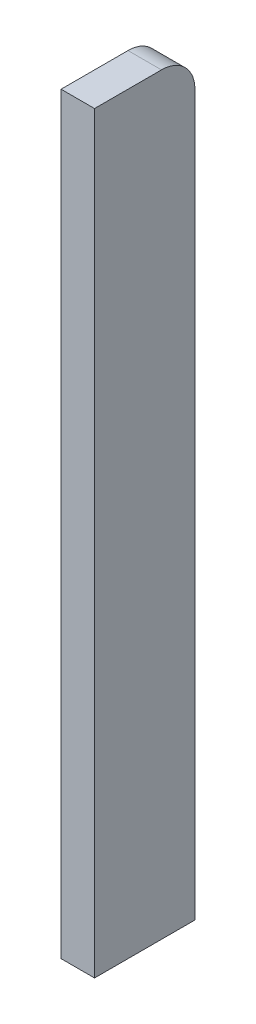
ISO-10303-21;
HEADER;
FILE_DESCRIPTION(('STEP AP214'),'2;1');
FILE_NAME('part.step','',(''),(''),'','','');
FILE_SCHEMA(('AUTOMOTIVE_DESIGN { 1 0 10303 214 1 1 1 1 }'));
ENDSEC;
DATA;
#1=APPLICATION_CONTEXT('core data for automotive mechanical design processes');
#2=APPLICATION_PROTOCOL_DEFINITION('international standard','automotive_design',2000,#1);
#3=PRODUCT_CONTEXT('',#1,'mechanical');
#4=PRODUCT('Part','Part','',(#3));
#5=PRODUCT_RELATED_PRODUCT_CATEGORY('part','',(#4));
#6=PRODUCT_DEFINITION_FORMATION('','',#4);
#7=PRODUCT_DEFINITION_CONTEXT('part definition',#1,'design');
#8=PRODUCT_DEFINITION('design','',#6,#7);
#9=PRODUCT_DEFINITION_SHAPE('','',#8);
#10=(LENGTH_UNIT() NAMED_UNIT(*) SI_UNIT(.MILLI.,.METRE.));
#11=(NAMED_UNIT(*) PLANE_ANGLE_UNIT() SI_UNIT($,.RADIAN.));
#12=(NAMED_UNIT(*) SI_UNIT($,.STERADIAN.) SOLID_ANGLE_UNIT());
#13=UNCERTAINTY_MEASURE_WITH_UNIT(LENGTH_MEASURE(1.E-05),#10,'distance_accuracy_value','');
#14=(GEOMETRIC_REPRESENTATION_CONTEXT(3) GLOBAL_UNCERTAINTY_ASSIGNED_CONTEXT((#13)) GLOBAL_UNIT_ASSIGNED_CONTEXT((#10,
#11,#12)) REPRESENTATION_CONTEXT('',''));
#15=CARTESIAN_POINT('',(0.,0.,0.));
#16=DIRECTION('',(0.,0.,1.));
#17=DIRECTION('',(1.,0.,0.));
#18=AXIS2_PLACEMENT_3D('',#15,#16,#17);
#19=CARTESIAN_POINT('',(0.,142.875,-19.05));
#20=DIRECTION('',(-1.,0.,0.));
#21=DIRECTION('',(0.,-1.,0.));
#22=AXIS2_PLACEMENT_3D('',#19,#20,#21);
#23=PLANE('',#22);
#24=DIRECTION('',(0.,-1.,0.));
#25=VECTOR('',#24,1.);
#26=CARTESIAN_POINT('',(0.,142.875,-19.05));
#27=LINE('',#26,#25);
#28=CARTESIAN_POINT('',(0.,136.525,-19.05));
#29=VERTEX_POINT('',#28);
#30=CARTESIAN_POINT('',(0.,0.,-19.05));
#31=VERTEX_POINT('',#30);
#32=EDGE_CURVE('E78',#29,#31,#27,.T.);
#33=ORIENTED_EDGE('',*,*,#32,.F.);
#34=CARTESIAN_POINT('',(0.,136.525,-12.7));
#35=DIRECTION('',(-1.,0.,0.));
#36=DIRECTION('',(0.,-1.,0.));
#37=AXIS2_PLACEMENT_3D('',#34,#35,#36);
#38=CIRCLE('',#37,6.35);
#39=CARTESIAN_POINT('',(0.,142.875,-12.7));
#40=VERTEX_POINT('',#39);
#41=EDGE_CURVE('E56',#29,#40,#38,.F.);
#42=ORIENTED_EDGE('',*,*,#41,.T.);
#43=DIRECTION('',(0.,0.,1.));
#44=VECTOR('',#43,1.);
#45=CARTESIAN_POINT('',(0.,142.875,-19.05));
#46=LINE('',#45,#44);
#47=CARTESIAN_POINT('',(0.,142.875,0.));
#48=VERTEX_POINT('',#47);
#49=EDGE_CURVE('E108',#40,#48,#46,.T.);
#50=ORIENTED_EDGE('',*,*,#49,.T.);
#51=DIRECTION('',(0.,-1.,0.));
#52=VECTOR('',#51,1.);
#53=CARTESIAN_POINT('',(0.,142.875,0.));
#54=LINE('',#53,#52);
#55=CARTESIAN_POINT('',(0.,0.,0.));
#56=VERTEX_POINT('',#55);
#57=EDGE_CURVE('E100',#48,#56,#54,.T.);
#58=ORIENTED_EDGE('',*,*,#57,.T.);
#59=DIRECTION('',(0.,0.,1.));
#60=VECTOR('',#59,1.);
#61=CARTESIAN_POINT('',(0.,0.,-19.05));
#62=LINE('',#61,#60);
#63=EDGE_CURVE('E92',#31,#56,#62,.T.);
#64=ORIENTED_EDGE('',*,*,#63,.F.);
#65=EDGE_LOOP('',(#33,#42,#50,#58,#64));
#66=FACE_BOUND('',#65,.T.);
#67=ADVANCED_FACE('F34',(#66),#23,.F.);
#68=CARTESIAN_POINT('',(0.,0.,-19.05));
#69=DIRECTION('',(0.,1.,0.));
#70=DIRECTION('',(0.,0.,1.));
#71=AXIS2_PLACEMENT_3D('',#68,#69,#70);
#72=PLANE('',#71);
#73=DIRECTION('',(-1.,0.,0.));
#74=VECTOR('',#73,1.);
#75=CARTESIAN_POINT('',(0.,0.,0.));
#76=LINE('',#75,#74);
#77=CARTESIAN_POINT('',(-6.34999999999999,0.,0.));
#78=VERTEX_POINT('',#77);
#79=EDGE_CURVE('E115',#56,#78,#76,.T.);
#80=ORIENTED_EDGE('',*,*,#79,.T.);
#81=DIRECTION('',(0.,0.,1.));
#82=VECTOR('',#81,1.);
#83=CARTESIAN_POINT('',(-6.34999999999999,0.,-19.05));
#84=LINE('',#83,#82);
#85=CARTESIAN_POINT('',(-6.34999999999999,0.,-19.05));
#86=VERTEX_POINT('',#85);
#87=EDGE_CURVE('E95',#86,#78,#84,.T.);
#88=ORIENTED_EDGE('',*,*,#87,.F.);
#89=DIRECTION('',(-1.,0.,0.));
#90=VECTOR('',#89,1.);
#91=CARTESIAN_POINT('',(0.,0.,-19.05));
#92=LINE('',#91,#90);
#93=EDGE_CURVE('E82',#31,#86,#92,.T.);
#94=ORIENTED_EDGE('',*,*,#93,.F.);
#95=ORIENTED_EDGE('',*,*,#63,.T.);
#96=EDGE_LOOP('',(#80,#88,#94,#95));
#97=FACE_BOUND('',#96,.T.);
#98=ADVANCED_FACE('F91',(#97),#72,.F.);
#99=CARTESIAN_POINT('',(-6.34999999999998,142.875,-19.05));
#100=DIRECTION('',(1.,0.,0.));
#101=DIRECTION('',(0.,1.,0.));
#102=AXIS2_PLACEMENT_3D('',#99,#100,#101);
#103=PLANE('',#102);
#104=DIRECTION('',(0.,0.,1.));
#105=VECTOR('',#104,1.);
#106=CARTESIAN_POINT('',(-6.34999999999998,142.875,-19.05));
#107=LINE('',#106,#105);
#108=CARTESIAN_POINT('',(-6.34999999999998,142.875,-12.7));
#109=VERTEX_POINT('',#108);
#110=CARTESIAN_POINT('',(-6.34999999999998,142.875,0.));
#111=VERTEX_POINT('',#110);
#112=EDGE_CURVE('E103',#109,#111,#107,.T.);
#113=ORIENTED_EDGE('',*,*,#112,.F.);
#114=CARTESIAN_POINT('',(-6.34999999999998,136.525,-12.7));
#115=DIRECTION('',(1.,0.,0.));
#116=DIRECTION('',(0.,1.,0.));
#117=AXIS2_PLACEMENT_3D('',#114,#115,#116);
#118=CIRCLE('',#117,6.35);
#119=CARTESIAN_POINT('',(-6.34999999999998,136.525,-19.05));
#120=VERTEX_POINT('',#119);
#121=EDGE_CURVE('E11',#109,#120,#118,.F.);
#122=ORIENTED_EDGE('',*,*,#121,.T.);
#123=DIRECTION('',(0.,1.,0.));
#124=VECTOR('',#123,1.);
#125=CARTESIAN_POINT('',(-6.34999999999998,142.875,-19.05));
#126=LINE('',#125,#124);
#127=EDGE_CURVE('E97',#86,#120,#126,.T.);
#128=ORIENTED_EDGE('',*,*,#127,.F.);
#129=ORIENTED_EDGE('',*,*,#87,.T.);
#130=DIRECTION('',(0.,1.,0.));
#131=VECTOR('',#130,1.);
#132=CARTESIAN_POINT('',(-6.34999999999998,142.875,0.));
#133=LINE('',#132,#131);
#134=EDGE_CURVE('E112',#78,#111,#133,.T.);
#135=ORIENTED_EDGE('',*,*,#134,.T.);
#136=EDGE_LOOP('',(#113,#122,#128,#129,#135));
#137=FACE_BOUND('',#136,.T.);
#138=ADVANCED_FACE('F121',(#137),#103,.F.);
#139=CARTESIAN_POINT('',(0.,142.875,-19.05));
#140=DIRECTION('',(0.,-1.,0.));
#141=DIRECTION('',(0.,0.,-1.));
#142=AXIS2_PLACEMENT_3D('',#139,#140,#141);
#143=PLANE('',#142);
#144=ORIENTED_EDGE('',*,*,#49,.F.);
#145=DIRECTION('',(1.,0.,0.));
#146=VECTOR('',#145,1.);
#147=CARTESIAN_POINT('',(-6.34999999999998,142.875,-12.7));
#148=LINE('',#147,#146);
#149=EDGE_CURVE('E42',#40,#109,#148,.F.);
#150=ORIENTED_EDGE('',*,*,#149,.T.);
#151=ORIENTED_EDGE('',*,*,#112,.T.);
#152=DIRECTION('',(1.,0.,0.));
#153=VECTOR('',#152,1.);
#154=CARTESIAN_POINT('',(0.,142.875,0.));
#155=LINE('',#154,#153);
#156=EDGE_CURVE('E87',#111,#48,#155,.T.);
#157=ORIENTED_EDGE('',*,*,#156,.T.);
#158=EDGE_LOOP('',(#144,#150,#151,#157));
#159=FACE_BOUND('',#158,.T.);
#160=ADVANCED_FACE('F124',(#159),#143,.F.);
#161=CARTESIAN_POINT('',(0.,0.,-19.05));
#162=DIRECTION('',(0.,0.,-1.));
#163=DIRECTION('',(-1.,0.,0.));
#164=AXIS2_PLACEMENT_3D('',#161,#162,#163);
#165=PLANE('',#164);
#166=ORIENTED_EDGE('',*,*,#127,.T.);
#167=DIRECTION('',(1.,0.,0.));
#168=VECTOR('',#167,1.);
#169=CARTESIAN_POINT('',(0.,136.525,-19.05));
#170=LINE('',#169,#168);
#171=EDGE_CURVE('E85',#120,#29,#170,.T.);
#172=ORIENTED_EDGE('',*,*,#171,.T.);
#173=ORIENTED_EDGE('',*,*,#32,.T.);
#174=ORIENTED_EDGE('',*,*,#93,.T.);
#175=EDGE_LOOP('',(#166,#172,#173,#174));
#176=FACE_BOUND('',#175,.T.);
#177=ADVANCED_FACE('F81',(#176),#165,.T.);
#178=CARTESIAN_POINT('',(0.,0.,0.));
#179=DIRECTION('',(0.,0.,-1.));
#180=DIRECTION('',(-1.,0.,0.));
#181=AXIS2_PLACEMENT_3D('',#178,#179,#180);
#182=PLANE('',#181);
#183=ORIENTED_EDGE('',*,*,#57,.F.);
#184=ORIENTED_EDGE('',*,*,#156,.F.);
#185=ORIENTED_EDGE('',*,*,#134,.F.);
#186=ORIENTED_EDGE('',*,*,#79,.F.);
#187=EDGE_LOOP('',(#183,#184,#185,#186));
#188=FACE_BOUND('',#187,.T.);
#189=ADVANCED_FACE('F126',(#188),#182,.F.);
#190=CARTESIAN_POINT('',(0.,136.525,-12.7));
#191=DIRECTION('',(-1.,0.,0.));
#192=DIRECTION('',(0.,0.,1.));
#193=AXIS2_PLACEMENT_3D('',#190,#191,#192);
#194=CYLINDRICAL_SURFACE('',#193,6.35);
#195=ORIENTED_EDGE('',*,*,#121,.F.);
#196=ORIENTED_EDGE('',*,*,#149,.F.);
#197=ORIENTED_EDGE('',*,*,#41,.F.);
#198=ORIENTED_EDGE('',*,*,#171,.F.);
#199=EDGE_LOOP('',(#195,#196,#197,#198));
#200=FACE_BOUND('',#199,.T.);
#201=ADVANCED_FACE('F36',(#200),#194,.T.);
#202=CLOSED_SHELL('',(#67,#98,#138,#160,#177,#189,#201));
#203=MANIFOLD_SOLID_BREP('B2',#202);
#204=ADVANCED_BREP_SHAPE_REPRESENTATION('',(#18,#203),#14);
#205=SHAPE_DEFINITION_REPRESENTATION(#9,#204);
ENDSEC;
END-ISO-10303-21;
